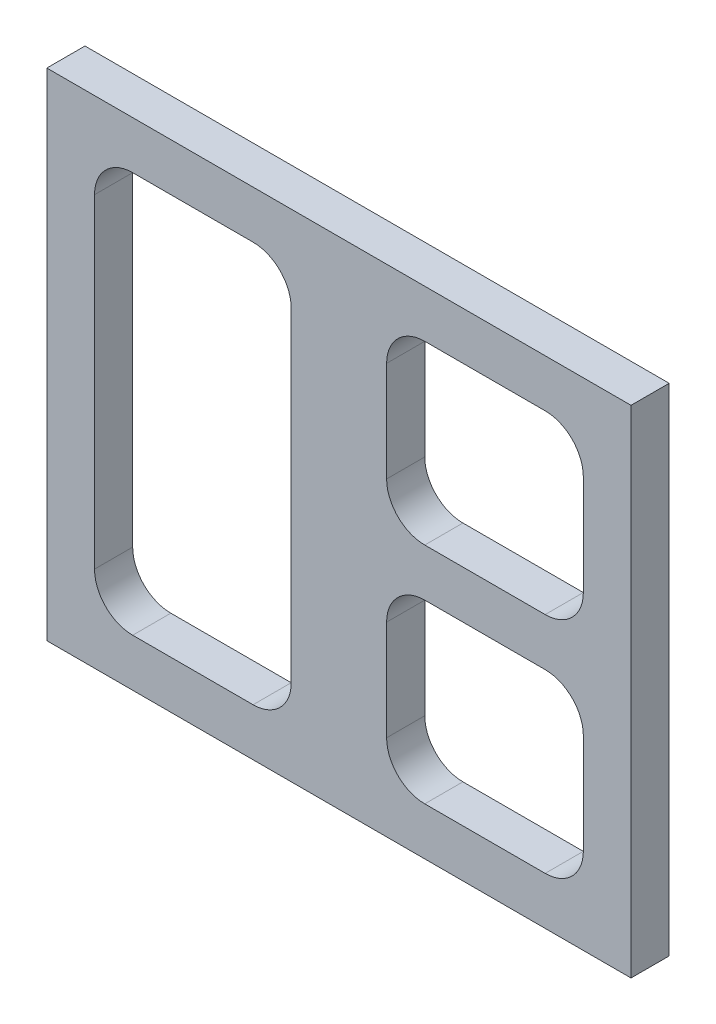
ISO-10303-21;
HEADER;
FILE_DESCRIPTION(('STEP AP214'),'2;1');
FILE_NAME('part.step','',(''),(''),'','','');
FILE_SCHEMA(('AUTOMOTIVE_DESIGN { 1 0 10303 214 1 1 1 1 }'));
ENDSEC;
DATA;
#1=APPLICATION_CONTEXT('core data for automotive mechanical design processes');
#2=APPLICATION_PROTOCOL_DEFINITION('international standard','automotive_design',2000,#1);
#3=PRODUCT_CONTEXT('',#1,'mechanical');
#4=PRODUCT('Part','Part','',(#3));
#5=PRODUCT_RELATED_PRODUCT_CATEGORY('part','',(#4));
#6=PRODUCT_DEFINITION_FORMATION('','',#4);
#7=PRODUCT_DEFINITION_CONTEXT('part definition',#1,'design');
#8=PRODUCT_DEFINITION('design','',#6,#7);
#9=PRODUCT_DEFINITION_SHAPE('','',#8);
#10=(LENGTH_UNIT() NAMED_UNIT(*) SI_UNIT(.MILLI.,.METRE.));
#11=(NAMED_UNIT(*) PLANE_ANGLE_UNIT() SI_UNIT($,.RADIAN.));
#12=(NAMED_UNIT(*) SI_UNIT($,.STERADIAN.) SOLID_ANGLE_UNIT());
#13=UNCERTAINTY_MEASURE_WITH_UNIT(LENGTH_MEASURE(1.E-05),#10,'distance_accuracy_value','');
#14=(GEOMETRIC_REPRESENTATION_CONTEXT(3) GLOBAL_UNCERTAINTY_ASSIGNED_CONTEXT((#13)) GLOBAL_UNIT_ASSIGNED_CONTEXT((#10,
#11,#12)) REPRESENTATION_CONTEXT('',''));
#15=CARTESIAN_POINT('',(0.,0.,0.));
#16=DIRECTION('',(0.,0.,1.));
#17=DIRECTION('',(1.,0.,0.));
#18=AXIS2_PLACEMENT_3D('',#15,#16,#17);
#19=CARTESIAN_POINT('',(122.5,-104.,16.));
#20=DIRECTION('',(0.,0.,1.));
#21=DIRECTION('',(1.,0.,0.));
#22=AXIS2_PLACEMENT_3D('',#19,#20,#21);
#23=PLANE('',#22);
#24=DIRECTION('',(0.,-1.,0.));
#25=VECTOR('',#24,1.);
#26=CARTESIAN_POINT('',(20.,67.9999999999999,16.));
#27=LINE('',#26,#25);
#28=CARTESIAN_POINT('',(20.,67.9999999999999,16.));
#29=VERTEX_POINT('',#28);
#30=CARTESIAN_POINT('',(20.,26.0000000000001,16.));
#31=VERTEX_POINT('',#30);
#32=EDGE_CURVE('E283',#29,#31,#27,.T.);
#33=ORIENTED_EDGE('',*,*,#32,.F.);
#34=CARTESIAN_POINT('',(36.,68.,16.));
#35=DIRECTION('',(0.,0.,1.));
#36=DIRECTION('',(-1.,0.,0.));
#37=AXIS2_PLACEMENT_3D('',#34,#35,#36);
#38=CIRCLE('',#37,16.);
#39=CARTESIAN_POINT('',(36.0000000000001,84.,16.));
#40=VERTEX_POINT('',#39);
#41=EDGE_CURVE('E281',#40,#29,#38,.T.);
#42=ORIENTED_EDGE('',*,*,#41,.F.);
#43=DIRECTION('',(-1.,0.,0.));
#44=VECTOR('',#43,1.);
#45=CARTESIAN_POINT('',(36.0000000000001,84.,16.));
#46=LINE('',#45,#44);
#47=CARTESIAN_POINT('',(86.4999999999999,84.,16.));
#48=VERTEX_POINT('',#47);
#49=EDGE_CURVE('E297',#48,#40,#46,.T.);
#50=ORIENTED_EDGE('',*,*,#49,.F.);
#51=CARTESIAN_POINT('',(86.5,68.,16.));
#52=DIRECTION('',(0.,0.,1.));
#53=DIRECTION('',(1.,0.,0.));
#54=AXIS2_PLACEMENT_3D('',#51,#52,#53);
#55=CIRCLE('',#54,16.);
#56=CARTESIAN_POINT('',(102.5,67.9999999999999,16.));
#57=VERTEX_POINT('',#56);
#58=EDGE_CURVE('E294',#57,#48,#55,.T.);
#59=ORIENTED_EDGE('',*,*,#58,.F.);
#60=DIRECTION('',(0.,1.,0.));
#61=VECTOR('',#60,1.);
#62=CARTESIAN_POINT('',(102.5,67.9999999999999,16.));
#63=LINE('',#62,#61);
#64=CARTESIAN_POINT('',(102.5,26.0000000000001,16.));
#65=VERTEX_POINT('',#64);
#66=EDGE_CURVE('E292',#65,#57,#63,.T.);
#67=ORIENTED_EDGE('',*,*,#66,.F.);
#68=CARTESIAN_POINT('',(86.5,26.,16.));
#69=DIRECTION('',(0.,0.,1.));
#70=DIRECTION('',(1.,0.,0.));
#71=AXIS2_PLACEMENT_3D('',#68,#69,#70);
#72=CIRCLE('',#71,16.);
#73=CARTESIAN_POINT('',(86.4999999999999,10.,16.));
#74=VERTEX_POINT('',#73);
#75=EDGE_CURVE('E290',#74,#65,#72,.T.);
#76=ORIENTED_EDGE('',*,*,#75,.F.);
#77=DIRECTION('',(1.,0.,0.));
#78=VECTOR('',#77,1.);
#79=CARTESIAN_POINT('',(36.0000000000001,10.,16.));
#80=LINE('',#79,#78);
#81=CARTESIAN_POINT('',(36.0000000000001,10.,16.));
#82=VERTEX_POINT('',#81);
#83=EDGE_CURVE('E288',#82,#74,#80,.T.);
#84=ORIENTED_EDGE('',*,*,#83,.F.);
#85=CARTESIAN_POINT('',(36.,26.,16.));
#86=DIRECTION('',(0.,0.,1.));
#87=DIRECTION('',(-1.,0.,0.));
#88=AXIS2_PLACEMENT_3D('',#85,#86,#87);
#89=CIRCLE('',#88,16.);
#90=EDGE_CURVE('E286',#31,#82,#89,.T.);
#91=ORIENTED_EDGE('',*,*,#90,.F.);
#92=EDGE_LOOP('',(#33,#42,#50,#59,#67,#76,#84,#91));
#93=FACE_BOUND('',#92,.T.);
#94=DIRECTION('',(0.,1.,0.));
#95=VECTOR('',#94,1.);
#96=CARTESIAN_POINT('',(122.5,104.,16.));
#97=LINE('',#96,#95);
#98=CARTESIAN_POINT('',(122.5,-104.,16.));
#99=VERTEX_POINT('',#98);
#100=CARTESIAN_POINT('',(122.5,104.,16.));
#101=VERTEX_POINT('',#100);
#102=EDGE_CURVE('E399',#99,#101,#97,.T.);
#103=ORIENTED_EDGE('',*,*,#102,.T.);
#104=DIRECTION('',(-1.,0.,0.));
#105=VECTOR('',#104,1.);
#106=CARTESIAN_POINT('',(-122.5,104.,16.));
#107=LINE('',#106,#105);
#108=CARTESIAN_POINT('',(-122.5,104.,16.));
#109=VERTEX_POINT('',#108);
#110=EDGE_CURVE('E402',#101,#109,#107,.T.);
#111=ORIENTED_EDGE('',*,*,#110,.T.);
#112=DIRECTION('',(0.,-1.,0.));
#113=VECTOR('',#112,1.);
#114=CARTESIAN_POINT('',(-122.5,104.,16.));
#115=LINE('',#114,#113);
#116=CARTESIAN_POINT('',(-122.5,-104.,16.));
#117=VERTEX_POINT('',#116);
#118=EDGE_CURVE('E405',#109,#117,#115,.T.);
#119=ORIENTED_EDGE('',*,*,#118,.T.);
#120=DIRECTION('',(1.,0.,0.));
#121=VECTOR('',#120,1.);
#122=CARTESIAN_POINT('',(-122.5,-104.,16.));
#123=LINE('',#122,#121);
#124=EDGE_CURVE('E407',#117,#99,#123,.T.);
#125=ORIENTED_EDGE('',*,*,#124,.T.);
#126=EDGE_LOOP('',(#103,#111,#119,#125));
#127=FACE_BOUND('',#126,.T.);
#128=DIRECTION('',(0.,-1.,0.));
#129=VECTOR('',#128,1.);
#130=CARTESIAN_POINT('',(-102.5,67.9999999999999,16.));
#131=LINE('',#130,#129);
#132=CARTESIAN_POINT('',(-102.5,67.9999999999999,16.));
#133=VERTEX_POINT('',#132);
#134=CARTESIAN_POINT('',(-102.5,-67.9999999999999,16.));
#135=VERTEX_POINT('',#134);
#136=EDGE_CURVE('E342',#133,#135,#131,.T.);
#137=ORIENTED_EDGE('',*,*,#136,.F.);
#138=CARTESIAN_POINT('',(-86.5,68.,16.));
#139=DIRECTION('',(0.,0.,1.));
#140=DIRECTION('',(-1.,0.,0.));
#141=AXIS2_PLACEMENT_3D('',#138,#139,#140);
#142=CIRCLE('',#141,16.);
#143=CARTESIAN_POINT('',(-86.4999999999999,84.,16.));
#144=VERTEX_POINT('',#143);
#145=EDGE_CURVE('E340',#144,#133,#142,.T.);
#146=ORIENTED_EDGE('',*,*,#145,.F.);
#147=DIRECTION('',(-1.,0.,0.));
#148=VECTOR('',#147,1.);
#149=CARTESIAN_POINT('',(-86.4999999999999,84.,16.));
#150=LINE('',#149,#148);
#151=CARTESIAN_POINT('',(-36.0000000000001,84.,16.));
#152=VERTEX_POINT('',#151);
#153=EDGE_CURVE('E356',#152,#144,#150,.T.);
#154=ORIENTED_EDGE('',*,*,#153,.F.);
#155=CARTESIAN_POINT('',(-36.,68.,16.));
#156=DIRECTION('',(0.,0.,1.));
#157=DIRECTION('',(1.,0.,0.));
#158=AXIS2_PLACEMENT_3D('',#155,#156,#157);
#159=CIRCLE('',#158,16.);
#160=CARTESIAN_POINT('',(-20.,67.9999999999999,16.));
#161=VERTEX_POINT('',#160);
#162=EDGE_CURVE('E353',#161,#152,#159,.T.);
#163=ORIENTED_EDGE('',*,*,#162,.F.);
#164=DIRECTION('',(0.,1.,0.));
#165=VECTOR('',#164,1.);
#166=CARTESIAN_POINT('',(-20.,67.9999999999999,16.));
#167=LINE('',#166,#165);
#168=CARTESIAN_POINT('',(-20.,-67.9999999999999,16.));
#169=VERTEX_POINT('',#168);
#170=EDGE_CURVE('E351',#169,#161,#167,.T.);
#171=ORIENTED_EDGE('',*,*,#170,.F.);
#172=CARTESIAN_POINT('',(-36.,-68.,16.));
#173=DIRECTION('',(0.,0.,1.));
#174=DIRECTION('',(-1.,0.,0.));
#175=AXIS2_PLACEMENT_3D('',#172,#173,#174);
#176=CIRCLE('',#175,16.);
#177=CARTESIAN_POINT('',(-36.0000000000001,-84.,16.));
#178=VERTEX_POINT('',#177);
#179=EDGE_CURVE('E349',#178,#169,#176,.T.);
#180=ORIENTED_EDGE('',*,*,#179,.F.);
#181=DIRECTION('',(1.,0.,0.));
#182=VECTOR('',#181,1.);
#183=CARTESIAN_POINT('',(-86.4999999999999,-84.,16.));
#184=LINE('',#183,#182);
#185=CARTESIAN_POINT('',(-86.4999999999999,-84.,16.));
#186=VERTEX_POINT('',#185);
#187=EDGE_CURVE('E347',#186,#178,#184,.T.);
#188=ORIENTED_EDGE('',*,*,#187,.F.);
#189=CARTESIAN_POINT('',(-86.5,-68.,16.));
#190=DIRECTION('',(0.,0.,1.));
#191=DIRECTION('',(1.,0.,0.));
#192=AXIS2_PLACEMENT_3D('',#189,#190,#191);
#193=CIRCLE('',#192,16.);
#194=EDGE_CURVE('E345',#135,#186,#193,.T.);
#195=ORIENTED_EDGE('',*,*,#194,.F.);
#196=EDGE_LOOP('',(#137,#146,#154,#163,#171,#180,#188,#195));
#197=FACE_BOUND('',#196,.T.);
#198=DIRECTION('',(0.,1.,0.));
#199=VECTOR('',#198,1.);
#200=CARTESIAN_POINT('',(102.5,-26.0000000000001,16.));
#201=LINE('',#200,#199);
#202=CARTESIAN_POINT('',(102.5,-67.9999999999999,16.));
#203=VERTEX_POINT('',#202);
#204=CARTESIAN_POINT('',(102.5,-26.0000000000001,16.));
#205=VERTEX_POINT('',#204);
#206=EDGE_CURVE('E224',#203,#205,#201,.T.);
#207=ORIENTED_EDGE('',*,*,#206,.F.);
#208=CARTESIAN_POINT('',(86.5,-68.,16.));
#209=DIRECTION('',(0.,0.,1.));
#210=DIRECTION('',(1.,0.,0.));
#211=AXIS2_PLACEMENT_3D('',#208,#209,#210);
#212=CIRCLE('',#211,16.);
#213=CARTESIAN_POINT('',(86.4999999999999,-84.,16.));
#214=VERTEX_POINT('',#213);
#215=EDGE_CURVE('E216',#214,#203,#212,.T.);
#216=ORIENTED_EDGE('',*,*,#215,.F.);
#217=DIRECTION('',(1.,0.,0.));
#218=VECTOR('',#217,1.);
#219=CARTESIAN_POINT('',(36.0000000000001,-84.,16.));
#220=LINE('',#219,#218);
#221=CARTESIAN_POINT('',(36.0000000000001,-84.,16.));
#222=VERTEX_POINT('',#221);
#223=EDGE_CURVE('E249',#222,#214,#220,.T.);
#224=ORIENTED_EDGE('',*,*,#223,.F.);
#225=CARTESIAN_POINT('',(36.,-68.,16.));
#226=DIRECTION('',(0.,0.,1.));
#227=DIRECTION('',(1.,0.,0.));
#228=AXIS2_PLACEMENT_3D('',#225,#226,#227);
#229=CIRCLE('',#228,16.);
#230=CARTESIAN_POINT('',(20.,-67.9999999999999,16.));
#231=VERTEX_POINT('',#230);
#232=EDGE_CURVE('E247',#231,#222,#229,.T.);
#233=ORIENTED_EDGE('',*,*,#232,.F.);
#234=DIRECTION('',(0.,-1.,0.));
#235=VECTOR('',#234,1.);
#236=CARTESIAN_POINT('',(20.,-26.0000000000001,16.));
#237=LINE('',#236,#235);
#238=CARTESIAN_POINT('',(20.,-26.0000000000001,16.));
#239=VERTEX_POINT('',#238);
#240=EDGE_CURVE('E245',#239,#231,#237,.T.);
#241=ORIENTED_EDGE('',*,*,#240,.F.);
#242=CARTESIAN_POINT('',(36.,-26.,16.));
#243=DIRECTION('',(0.,0.,1.));
#244=DIRECTION('',(1.,0.,0.));
#245=AXIS2_PLACEMENT_3D('',#242,#243,#244);
#246=CIRCLE('',#245,16.);
#247=CARTESIAN_POINT('',(36.0000000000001,-9.99999999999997,16.));
#248=VERTEX_POINT('',#247);
#249=EDGE_CURVE('E243',#248,#239,#246,.T.);
#250=ORIENTED_EDGE('',*,*,#249,.F.);
#251=DIRECTION('',(-1.,0.,0.));
#252=VECTOR('',#251,1.);
#253=CARTESIAN_POINT('',(36.0000000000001,-9.99999999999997,16.));
#254=LINE('',#253,#252);
#255=CARTESIAN_POINT('',(86.4999999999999,-9.99999999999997,16.));
#256=VERTEX_POINT('',#255);
#257=EDGE_CURVE('E239',#256,#248,#254,.T.);
#258=ORIENTED_EDGE('',*,*,#257,.F.);
#259=CARTESIAN_POINT('',(86.5,-26.,16.));
#260=DIRECTION('',(0.,0.,1.));
#261=DIRECTION('',(-1.,0.,0.));
#262=AXIS2_PLACEMENT_3D('',#259,#260,#261);
#263=CIRCLE('',#262,16.);
#264=EDGE_CURVE('E237',#205,#256,#263,.T.);
#265=ORIENTED_EDGE('',*,*,#264,.F.);
#266=EDGE_LOOP('',(#207,#216,#224,#233,#241,#250,#258,#265));
#267=FACE_BOUND('',#266,.T.);
#268=ADVANCED_FACE('F31',(#93,#127,#197,#267),#23,.T.);
#269=CARTESIAN_POINT('',(122.5,-104.,0.));
#270=DIRECTION('',(0.,0.,1.));
#271=DIRECTION('',(1.,0.,0.));
#272=AXIS2_PLACEMENT_3D('',#269,#270,#271);
#273=PLANE('',#272);
#274=CARTESIAN_POINT('',(36.,68.,0.));
#275=DIRECTION('',(0.,0.,1.));
#276=DIRECTION('',(-1.,0.,0.));
#277=AXIS2_PLACEMENT_3D('',#274,#275,#276);
#278=CIRCLE('',#277,16.);
#279=CARTESIAN_POINT('',(36.0000000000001,84.,0.));
#280=VERTEX_POINT('',#279);
#281=CARTESIAN_POINT('',(20.,67.9999999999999,0.));
#282=VERTEX_POINT('',#281);
#283=EDGE_CURVE('E232',#280,#282,#278,.T.);
#284=ORIENTED_EDGE('',*,*,#283,.T.);
#285=DIRECTION('',(0.,-1.,0.));
#286=VECTOR('',#285,1.);
#287=CARTESIAN_POINT('',(20.,67.9999999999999,0.));
#288=LINE('',#287,#286);
#289=CARTESIAN_POINT('',(20.,26.0000000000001,0.));
#290=VERTEX_POINT('',#289);
#291=EDGE_CURVE('E302',#282,#290,#288,.T.);
#292=ORIENTED_EDGE('',*,*,#291,.T.);
#293=CARTESIAN_POINT('',(36.,26.,0.));
#294=DIRECTION('',(0.,0.,1.));
#295=DIRECTION('',(-1.,0.,0.));
#296=AXIS2_PLACEMENT_3D('',#293,#294,#295);
#297=CIRCLE('',#296,16.);
#298=CARTESIAN_POINT('',(36.0000000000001,10.,0.));
#299=VERTEX_POINT('',#298);
#300=EDGE_CURVE('E305',#290,#299,#297,.T.);
#301=ORIENTED_EDGE('',*,*,#300,.T.);
#302=DIRECTION('',(1.,0.,0.));
#303=VECTOR('',#302,1.);
#304=CARTESIAN_POINT('',(36.0000000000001,10.,0.));
#305=LINE('',#304,#303);
#306=CARTESIAN_POINT('',(86.4999999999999,10.,0.));
#307=VERTEX_POINT('',#306);
#308=EDGE_CURVE('E308',#299,#307,#305,.T.);
#309=ORIENTED_EDGE('',*,*,#308,.T.);
#310=CARTESIAN_POINT('',(86.5,26.,0.));
#311=DIRECTION('',(0.,0.,1.));
#312=DIRECTION('',(1.,0.,0.));
#313=AXIS2_PLACEMENT_3D('',#310,#311,#312);
#314=CIRCLE('',#313,16.);
#315=CARTESIAN_POINT('',(102.5,26.0000000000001,0.));
#316=VERTEX_POINT('',#315);
#317=EDGE_CURVE('E311',#307,#316,#314,.T.);
#318=ORIENTED_EDGE('',*,*,#317,.T.);
#319=DIRECTION('',(0.,1.,0.));
#320=VECTOR('',#319,1.);
#321=CARTESIAN_POINT('',(102.5,67.9999999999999,0.));
#322=LINE('',#321,#320);
#323=CARTESIAN_POINT('',(102.5,67.9999999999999,0.));
#324=VERTEX_POINT('',#323);
#325=EDGE_CURVE('E314',#316,#324,#322,.T.);
#326=ORIENTED_EDGE('',*,*,#325,.T.);
#327=CARTESIAN_POINT('',(86.5,68.,0.));
#328=DIRECTION('',(0.,0.,1.));
#329=DIRECTION('',(1.,0.,0.));
#330=AXIS2_PLACEMENT_3D('',#327,#328,#329);
#331=CIRCLE('',#330,16.);
#332=CARTESIAN_POINT('',(86.4999999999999,84.,0.));
#333=VERTEX_POINT('',#332);
#334=EDGE_CURVE('E317',#324,#333,#331,.T.);
#335=ORIENTED_EDGE('',*,*,#334,.T.);
#336=DIRECTION('',(-1.,0.,0.));
#337=VECTOR('',#336,1.);
#338=CARTESIAN_POINT('',(36.0000000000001,84.,0.));
#339=LINE('',#338,#337);
#340=EDGE_CURVE('E284',#333,#280,#339,.T.);
#341=ORIENTED_EDGE('',*,*,#340,.T.);
#342=EDGE_LOOP('',(#284,#292,#301,#309,#318,#326,#335,#341));
#343=FACE_BOUND('',#342,.T.);
#344=DIRECTION('',(0.,1.,0.));
#345=VECTOR('',#344,1.);
#346=CARTESIAN_POINT('',(122.5,104.,0.));
#347=LINE('',#346,#345);
#348=CARTESIAN_POINT('',(122.5,-104.,0.));
#349=VERTEX_POINT('',#348);
#350=CARTESIAN_POINT('',(122.5,104.,0.));
#351=VERTEX_POINT('',#350);
#352=EDGE_CURVE('E398',#349,#351,#347,.T.);
#353=ORIENTED_EDGE('',*,*,#352,.F.);
#354=DIRECTION('',(1.,0.,0.));
#355=VECTOR('',#354,1.);
#356=CARTESIAN_POINT('',(-122.5,-104.,0.));
#357=LINE('',#356,#355);
#358=CARTESIAN_POINT('',(-122.5,-104.,0.));
#359=VERTEX_POINT('',#358);
#360=EDGE_CURVE('E403',#359,#349,#357,.T.);
#361=ORIENTED_EDGE('',*,*,#360,.F.);
#362=DIRECTION('',(0.,-1.,0.));
#363=VECTOR('',#362,1.);
#364=CARTESIAN_POINT('',(-122.5,104.,0.));
#365=LINE('',#364,#363);
#366=CARTESIAN_POINT('',(-122.5,104.,0.));
#367=VERTEX_POINT('',#366);
#368=EDGE_CURVE('E414',#367,#359,#365,.T.);
#369=ORIENTED_EDGE('',*,*,#368,.F.);
#370=DIRECTION('',(-1.,0.,0.));
#371=VECTOR('',#370,1.);
#372=CARTESIAN_POINT('',(-122.5,104.,0.));
#373=LINE('',#372,#371);
#374=EDGE_CURVE('E412',#351,#367,#373,.T.);
#375=ORIENTED_EDGE('',*,*,#374,.F.);
#376=EDGE_LOOP('',(#353,#361,#369,#375));
#377=FACE_BOUND('',#376,.T.);
#378=CARTESIAN_POINT('',(-86.5,68.,0.));
#379=DIRECTION('',(0.,0.,1.));
#380=DIRECTION('',(-1.,0.,0.));
#381=AXIS2_PLACEMENT_3D('',#378,#379,#380);
#382=CIRCLE('',#381,16.);
#383=CARTESIAN_POINT('',(-86.4999999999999,84.,0.));
#384=VERTEX_POINT('',#383);
#385=CARTESIAN_POINT('',(-102.5,67.9999999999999,0.));
#386=VERTEX_POINT('',#385);
#387=EDGE_CURVE('E339',#384,#386,#382,.T.);
#388=ORIENTED_EDGE('',*,*,#387,.T.);
#389=DIRECTION('',(0.,-1.,0.));
#390=VECTOR('',#389,1.);
#391=CARTESIAN_POINT('',(-102.5,67.9999999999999,0.));
#392=LINE('',#391,#390);
#393=CARTESIAN_POINT('',(-102.5,-67.9999999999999,0.));
#394=VERTEX_POINT('',#393);
#395=EDGE_CURVE('E361',#386,#394,#392,.T.);
#396=ORIENTED_EDGE('',*,*,#395,.T.);
#397=CARTESIAN_POINT('',(-86.5,-68.,0.));
#398=DIRECTION('',(0.,0.,1.));
#399=DIRECTION('',(1.,0.,0.));
#400=AXIS2_PLACEMENT_3D('',#397,#398,#399);
#401=CIRCLE('',#400,16.);
#402=CARTESIAN_POINT('',(-86.4999999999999,-84.,0.));
#403=VERTEX_POINT('',#402);
#404=EDGE_CURVE('E364',#394,#403,#401,.T.);
#405=ORIENTED_EDGE('',*,*,#404,.T.);
#406=DIRECTION('',(1.,0.,0.));
#407=VECTOR('',#406,1.);
#408=CARTESIAN_POINT('',(-86.4999999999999,-84.,0.));
#409=LINE('',#408,#407);
#410=CARTESIAN_POINT('',(-36.0000000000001,-84.,0.));
#411=VERTEX_POINT('',#410);
#412=EDGE_CURVE('E367',#403,#411,#409,.T.);
#413=ORIENTED_EDGE('',*,*,#412,.T.);
#414=CARTESIAN_POINT('',(-36.,-68.,0.));
#415=DIRECTION('',(0.,0.,1.));
#416=DIRECTION('',(-1.,0.,0.));
#417=AXIS2_PLACEMENT_3D('',#414,#415,#416);
#418=CIRCLE('',#417,16.);
#419=CARTESIAN_POINT('',(-20.,-67.9999999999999,0.));
#420=VERTEX_POINT('',#419);
#421=EDGE_CURVE('E370',#411,#420,#418,.T.);
#422=ORIENTED_EDGE('',*,*,#421,.T.);
#423=DIRECTION('',(0.,1.,0.));
#424=VECTOR('',#423,1.);
#425=CARTESIAN_POINT('',(-20.,67.9999999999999,0.));
#426=LINE('',#425,#424);
#427=CARTESIAN_POINT('',(-20.,67.9999999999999,0.));
#428=VERTEX_POINT('',#427);
#429=EDGE_CURVE('E373',#420,#428,#426,.T.);
#430=ORIENTED_EDGE('',*,*,#429,.T.);
#431=CARTESIAN_POINT('',(-36.,68.,0.));
#432=DIRECTION('',(0.,0.,1.));
#433=DIRECTION('',(1.,0.,0.));
#434=AXIS2_PLACEMENT_3D('',#431,#432,#433);
#435=CIRCLE('',#434,16.);
#436=CARTESIAN_POINT('',(-36.0000000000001,84.,0.));
#437=VERTEX_POINT('',#436);
#438=EDGE_CURVE('E376',#428,#437,#435,.T.);
#439=ORIENTED_EDGE('',*,*,#438,.T.);
#440=DIRECTION('',(-1.,0.,0.));
#441=VECTOR('',#440,1.);
#442=CARTESIAN_POINT('',(-86.4999999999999,84.,0.));
#443=LINE('',#442,#441);
#444=EDGE_CURVE('E343',#437,#384,#443,.T.);
#445=ORIENTED_EDGE('',*,*,#444,.T.);
#446=EDGE_LOOP('',(#388,#396,#405,#413,#422,#430,#439,#445));
#447=FACE_BOUND('',#446,.T.);
#448=CARTESIAN_POINT('',(86.5,-68.,0.));
#449=DIRECTION('',(0.,0.,1.));
#450=DIRECTION('',(1.,0.,0.));
#451=AXIS2_PLACEMENT_3D('',#448,#449,#450);
#452=CIRCLE('',#451,16.);
#453=CARTESIAN_POINT('',(86.4999999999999,-84.,0.));
#454=VERTEX_POINT('',#453);
#455=CARTESIAN_POINT('',(102.5,-67.9999999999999,0.));
#456=VERTEX_POINT('',#455);
#457=EDGE_CURVE('E54',#454,#456,#452,.T.);
#458=ORIENTED_EDGE('',*,*,#457,.T.);
#459=DIRECTION('',(0.,1.,0.));
#460=VECTOR('',#459,1.);
#461=CARTESIAN_POINT('',(102.5,-26.0000000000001,0.));
#462=LINE('',#461,#460);
#463=CARTESIAN_POINT('',(102.5,-26.0000000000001,0.));
#464=VERTEX_POINT('',#463);
#465=EDGE_CURVE('E231',#456,#464,#462,.T.);
#466=ORIENTED_EDGE('',*,*,#465,.T.);
#467=CARTESIAN_POINT('',(86.5,-26.,0.));
#468=DIRECTION('',(0.,0.,1.));
#469=DIRECTION('',(-1.,0.,0.));
#470=AXIS2_PLACEMENT_3D('',#467,#468,#469);
#471=CIRCLE('',#470,16.);
#472=CARTESIAN_POINT('',(86.4999999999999,-9.99999999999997,0.));
#473=VERTEX_POINT('',#472);
#474=EDGE_CURVE('E253',#464,#473,#471,.T.);
#475=ORIENTED_EDGE('',*,*,#474,.T.);
#476=DIRECTION('',(-1.,0.,0.));
#477=VECTOR('',#476,1.);
#478=CARTESIAN_POINT('',(36.0000000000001,-9.99999999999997,0.));
#479=LINE('',#478,#477);
#480=CARTESIAN_POINT('',(36.0000000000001,-9.99999999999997,0.));
#481=VERTEX_POINT('',#480);
#482=EDGE_CURVE('E256',#473,#481,#479,.T.);
#483=ORIENTED_EDGE('',*,*,#482,.T.);
#484=CARTESIAN_POINT('',(36.,-26.,0.));
#485=DIRECTION('',(0.,0.,1.));
#486=DIRECTION('',(1.,0.,0.));
#487=AXIS2_PLACEMENT_3D('',#484,#485,#486);
#488=CIRCLE('',#487,16.);
#489=CARTESIAN_POINT('',(20.,-26.0000000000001,0.));
#490=VERTEX_POINT('',#489);
#491=EDGE_CURVE('E259',#481,#490,#488,.T.);
#492=ORIENTED_EDGE('',*,*,#491,.T.);
#493=DIRECTION('',(0.,-1.,0.));
#494=VECTOR('',#493,1.);
#495=CARTESIAN_POINT('',(20.,-26.0000000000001,0.));
#496=LINE('',#495,#494);
#497=CARTESIAN_POINT('',(20.,-67.9999999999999,0.));
#498=VERTEX_POINT('',#497);
#499=EDGE_CURVE('E262',#490,#498,#496,.T.);
#500=ORIENTED_EDGE('',*,*,#499,.T.);
#501=CARTESIAN_POINT('',(36.,-68.,0.));
#502=DIRECTION('',(0.,0.,1.));
#503=DIRECTION('',(1.,0.,0.));
#504=AXIS2_PLACEMENT_3D('',#501,#502,#503);
#505=CIRCLE('',#504,16.);
#506=CARTESIAN_POINT('',(36.0000000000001,-84.,0.));
#507=VERTEX_POINT('',#506);
#508=EDGE_CURVE('E265',#498,#507,#505,.T.);
#509=ORIENTED_EDGE('',*,*,#508,.T.);
#510=DIRECTION('',(1.,0.,0.));
#511=VECTOR('',#510,1.);
#512=CARTESIAN_POINT('',(36.0000000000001,-84.,0.));
#513=LINE('',#512,#511);
#514=EDGE_CURVE('E225',#507,#454,#513,.T.);
#515=ORIENTED_EDGE('',*,*,#514,.T.);
#516=EDGE_LOOP('',(#458,#466,#475,#483,#492,#500,#509,#515));
#517=FACE_BOUND('',#516,.T.);
#518=ADVANCED_FACE('F432',(#343,#377,#447,#517),#273,.F.);
#519=CARTESIAN_POINT('',(122.5,104.,16.));
#520=DIRECTION('',(-1.,0.,0.));
#521=DIRECTION('',(0.,-1.,0.));
#522=AXIS2_PLACEMENT_3D('',#519,#520,#521);
#523=PLANE('',#522);
#524=ORIENTED_EDGE('',*,*,#352,.T.);
#525=DIRECTION('',(0.,0.,-1.));
#526=VECTOR('',#525,1.);
#527=CARTESIAN_POINT('',(122.5,104.,16.));
#528=LINE('',#527,#526);
#529=EDGE_CURVE('E11',#101,#351,#528,.T.);
#530=ORIENTED_EDGE('',*,*,#529,.F.);
#531=ORIENTED_EDGE('',*,*,#102,.F.);
#532=DIRECTION('',(0.,0.,-1.));
#533=VECTOR('',#532,1.);
#534=CARTESIAN_POINT('',(122.5,-104.,16.));
#535=LINE('',#534,#533);
#536=EDGE_CURVE('E409',#99,#349,#535,.T.);
#537=ORIENTED_EDGE('',*,*,#536,.T.);
#538=EDGE_LOOP('',(#524,#530,#531,#537));
#539=FACE_BOUND('',#538,.T.);
#540=ADVANCED_FACE('F33',(#539),#523,.F.);
#541=CARTESIAN_POINT('',(-122.5,104.,16.));
#542=DIRECTION('',(0.,-1.,0.));
#543=DIRECTION('',(0.,0.,-1.));
#544=AXIS2_PLACEMENT_3D('',#541,#542,#543);
#545=PLANE('',#544);
#546=ORIENTED_EDGE('',*,*,#374,.T.);
#547=DIRECTION('',(0.,0.,-1.));
#548=VECTOR('',#547,1.);
#549=CARTESIAN_POINT('',(-122.5,104.,16.));
#550=LINE('',#549,#548);
#551=EDGE_CURVE('E39',#109,#367,#550,.T.);
#552=ORIENTED_EDGE('',*,*,#551,.F.);
#553=ORIENTED_EDGE('',*,*,#110,.F.);
#554=ORIENTED_EDGE('',*,*,#529,.T.);
#555=EDGE_LOOP('',(#546,#552,#553,#554));
#556=FACE_BOUND('',#555,.T.);
#557=ADVANCED_FACE('F443',(#556),#545,.F.);
#558=CARTESIAN_POINT('',(-122.5,104.,16.));
#559=DIRECTION('',(1.,0.,0.));
#560=DIRECTION('',(0.,1.,0.));
#561=AXIS2_PLACEMENT_3D('',#558,#559,#560);
#562=PLANE('',#561);
#563=ORIENTED_EDGE('',*,*,#368,.T.);
#564=DIRECTION('',(0.,0.,-1.));
#565=VECTOR('',#564,1.);
#566=CARTESIAN_POINT('',(-122.5,-104.,16.));
#567=LINE('',#566,#565);
#568=EDGE_CURVE('E419',#117,#359,#567,.T.);
#569=ORIENTED_EDGE('',*,*,#568,.F.);
#570=ORIENTED_EDGE('',*,*,#118,.F.);
#571=ORIENTED_EDGE('',*,*,#551,.T.);
#572=EDGE_LOOP('',(#563,#569,#570,#571));
#573=FACE_BOUND('',#572,.T.);
#574=ADVANCED_FACE('F426',(#573),#562,.F.);
#575=CARTESIAN_POINT('',(-122.5,-104.,16.));
#576=DIRECTION('',(0.,1.,0.));
#577=DIRECTION('',(-1.,0.,0.));
#578=AXIS2_PLACEMENT_3D('',#575,#576,#577);
#579=PLANE('',#578);
#580=ORIENTED_EDGE('',*,*,#360,.T.);
#581=ORIENTED_EDGE('',*,*,#536,.F.);
#582=ORIENTED_EDGE('',*,*,#124,.F.);
#583=ORIENTED_EDGE('',*,*,#568,.T.);
#584=EDGE_LOOP('',(#580,#581,#582,#583));
#585=FACE_BOUND('',#584,.T.);
#586=ADVANCED_FACE('F436',(#585),#579,.F.);
#587=CARTESIAN_POINT('',(-86.5,68.,16.));
#588=DIRECTION('',(0.,0.,-1.));
#589=DIRECTION('',(-1.,0.,0.));
#590=AXIS2_PLACEMENT_3D('',#587,#588,#589);
#591=CYLINDRICAL_SURFACE('',#590,16.);
#592=ORIENTED_EDGE('',*,*,#387,.F.);
#593=DIRECTION('',(0.,0.,-1.));
#594=VECTOR('',#593,1.);
#595=CARTESIAN_POINT('',(-86.4999999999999,84.,16.));
#596=LINE('',#595,#594);
#597=EDGE_CURVE('E358',#144,#384,#596,.T.);
#598=ORIENTED_EDGE('',*,*,#597,.F.);
#599=ORIENTED_EDGE('',*,*,#145,.T.);
#600=DIRECTION('',(0.,0.,-1.));
#601=VECTOR('',#600,1.);
#602=CARTESIAN_POINT('',(-102.5,67.9999999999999,16.));
#603=LINE('',#602,#601);
#604=EDGE_CURVE('E395',#133,#386,#603,.T.);
#605=ORIENTED_EDGE('',*,*,#604,.T.);
#606=EDGE_LOOP('',(#592,#598,#599,#605));
#607=FACE_BOUND('',#606,.T.);
#608=ADVANCED_FACE('F460',(#607),#591,.F.);
#609=CARTESIAN_POINT('',(-102.5,67.9999999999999,16.));
#610=DIRECTION('',(1.,0.,0.));
#611=DIRECTION('',(0.,1.,0.));
#612=AXIS2_PLACEMENT_3D('',#609,#610,#611);
#613=PLANE('',#612);
#614=ORIENTED_EDGE('',*,*,#395,.F.);
#615=ORIENTED_EDGE('',*,*,#604,.F.);
#616=ORIENTED_EDGE('',*,*,#136,.T.);
#617=DIRECTION('',(0.,0.,-1.));
#618=VECTOR('',#617,1.);
#619=CARTESIAN_POINT('',(-102.5,-67.9999999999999,16.));
#620=LINE('',#619,#618);
#621=EDGE_CURVE('E393',#135,#394,#620,.T.);
#622=ORIENTED_EDGE('',*,*,#621,.T.);
#623=EDGE_LOOP('',(#614,#615,#616,#622));
#624=FACE_BOUND('',#623,.T.);
#625=ADVANCED_FACE('F467',(#624),#613,.T.);
#626=CARTESIAN_POINT('',(-86.5,-68.,16.));
#627=DIRECTION('',(0.,0.,-1.));
#628=DIRECTION('',(-1.,0.,0.));
#629=AXIS2_PLACEMENT_3D('',#626,#627,#628);
#630=CYLINDRICAL_SURFACE('',#629,16.);
#631=ORIENTED_EDGE('',*,*,#404,.F.);
#632=ORIENTED_EDGE('',*,*,#621,.F.);
#633=ORIENTED_EDGE('',*,*,#194,.T.);
#634=DIRECTION('',(0.,0.,-1.));
#635=VECTOR('',#634,1.);
#636=CARTESIAN_POINT('',(-86.4999999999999,-84.,16.));
#637=LINE('',#636,#635);
#638=EDGE_CURVE('E391',#186,#403,#637,.T.);
#639=ORIENTED_EDGE('',*,*,#638,.T.);
#640=EDGE_LOOP('',(#631,#632,#633,#639));
#641=FACE_BOUND('',#640,.T.);
#642=ADVANCED_FACE('F472',(#641),#630,.F.);
#643=CARTESIAN_POINT('',(-86.4999999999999,-84.,16.));
#644=DIRECTION('',(0.,1.,0.));
#645=DIRECTION('',(-1.,0.,0.));
#646=AXIS2_PLACEMENT_3D('',#643,#644,#645);
#647=PLANE('',#646);
#648=ORIENTED_EDGE('',*,*,#412,.F.);
#649=ORIENTED_EDGE('',*,*,#638,.F.);
#650=ORIENTED_EDGE('',*,*,#187,.T.);
#651=DIRECTION('',(0.,0.,-1.));
#652=VECTOR('',#651,1.);
#653=CARTESIAN_POINT('',(-36.0000000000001,-84.,16.));
#654=LINE('',#653,#652);
#655=EDGE_CURVE('E389',#178,#411,#654,.T.);
#656=ORIENTED_EDGE('',*,*,#655,.T.);
#657=EDGE_LOOP('',(#648,#649,#650,#656));
#658=FACE_BOUND('',#657,.T.);
#659=ADVANCED_FACE('F498',(#658),#647,.T.);
#660=CARTESIAN_POINT('',(-36.,-68.,16.));
#661=DIRECTION('',(0.,0.,-1.));
#662=DIRECTION('',(-1.,0.,0.));
#663=AXIS2_PLACEMENT_3D('',#660,#661,#662);
#664=CYLINDRICAL_SURFACE('',#663,16.);
#665=ORIENTED_EDGE('',*,*,#421,.F.);
#666=ORIENTED_EDGE('',*,*,#655,.F.);
#667=ORIENTED_EDGE('',*,*,#179,.T.);
#668=DIRECTION('',(0.,0.,-1.));
#669=VECTOR('',#668,1.);
#670=CARTESIAN_POINT('',(-20.,-67.9999999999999,16.));
#671=LINE('',#670,#669);
#672=EDGE_CURVE('E387',#169,#420,#671,.T.);
#673=ORIENTED_EDGE('',*,*,#672,.T.);
#674=EDGE_LOOP('',(#665,#666,#667,#673));
#675=FACE_BOUND('',#674,.T.);
#676=ADVANCED_FACE('F503',(#675),#664,.F.);
#677=CARTESIAN_POINT('',(-20.,67.9999999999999,16.));
#678=DIRECTION('',(-1.,0.,0.));
#679=DIRECTION('',(0.,-1.,0.));
#680=AXIS2_PLACEMENT_3D('',#677,#678,#679);
#681=PLANE('',#680);
#682=ORIENTED_EDGE('',*,*,#429,.F.);
#683=ORIENTED_EDGE('',*,*,#672,.F.);
#684=ORIENTED_EDGE('',*,*,#170,.T.);
#685=DIRECTION('',(0.,0.,-1.));
#686=VECTOR('',#685,1.);
#687=CARTESIAN_POINT('',(-20.,67.9999999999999,16.));
#688=LINE('',#687,#686);
#689=EDGE_CURVE('E385',#161,#428,#688,.T.);
#690=ORIENTED_EDGE('',*,*,#689,.T.);
#691=EDGE_LOOP('',(#682,#683,#684,#690));
#692=FACE_BOUND('',#691,.T.);
#693=ADVANCED_FACE('F506',(#692),#681,.T.);
#694=CARTESIAN_POINT('',(-36.,68.,16.));
#695=DIRECTION('',(0.,0.,-1.));
#696=DIRECTION('',(-1.,0.,0.));
#697=AXIS2_PLACEMENT_3D('',#694,#695,#696);
#698=CYLINDRICAL_SURFACE('',#697,16.);
#699=ORIENTED_EDGE('',*,*,#438,.F.);
#700=ORIENTED_EDGE('',*,*,#689,.F.);
#701=ORIENTED_EDGE('',*,*,#162,.T.);
#702=DIRECTION('',(0.,0.,-1.));
#703=VECTOR('',#702,1.);
#704=CARTESIAN_POINT('',(-36.0000000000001,84.,16.));
#705=LINE('',#704,#703);
#706=EDGE_CURVE('E383',#152,#437,#705,.T.);
#707=ORIENTED_EDGE('',*,*,#706,.T.);
#708=EDGE_LOOP('',(#699,#700,#701,#707));
#709=FACE_BOUND('',#708,.T.);
#710=ADVANCED_FACE('F486',(#709),#698,.F.);
#711=CARTESIAN_POINT('',(-86.4999999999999,84.,16.));
#712=DIRECTION('',(0.,-1.,0.));
#713=DIRECTION('',(0.,0.,-1.));
#714=AXIS2_PLACEMENT_3D('',#711,#712,#713);
#715=PLANE('',#714);
#716=ORIENTED_EDGE('',*,*,#444,.F.);
#717=ORIENTED_EDGE('',*,*,#706,.F.);
#718=ORIENTED_EDGE('',*,*,#153,.T.);
#719=ORIENTED_EDGE('',*,*,#597,.T.);
#720=EDGE_LOOP('',(#716,#717,#718,#719));
#721=FACE_BOUND('',#720,.T.);
#722=ADVANCED_FACE('F479',(#721),#715,.T.);
#723=CARTESIAN_POINT('',(36.,68.,16.));
#724=DIRECTION('',(0.,0.,-1.));
#725=DIRECTION('',(-1.,0.,0.));
#726=AXIS2_PLACEMENT_3D('',#723,#724,#725);
#727=CYLINDRICAL_SURFACE('',#726,16.);
#728=ORIENTED_EDGE('',*,*,#283,.F.);
#729=DIRECTION('',(0.,0.,-1.));
#730=VECTOR('',#729,1.);
#731=CARTESIAN_POINT('',(36.0000000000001,84.,16.));
#732=LINE('',#731,#730);
#733=EDGE_CURVE('E299',#40,#280,#732,.T.);
#734=ORIENTED_EDGE('',*,*,#733,.F.);
#735=ORIENTED_EDGE('',*,*,#41,.T.);
#736=DIRECTION('',(0.,0.,-1.));
#737=VECTOR('',#736,1.);
#738=CARTESIAN_POINT('',(20.,67.9999999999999,16.));
#739=LINE('',#738,#737);
#740=EDGE_CURVE('E336',#29,#282,#739,.T.);
#741=ORIENTED_EDGE('',*,*,#740,.T.);
#742=EDGE_LOOP('',(#728,#734,#735,#741));
#743=FACE_BOUND('',#742,.T.);
#744=ADVANCED_FACE('F551',(#743),#727,.F.);
#745=CARTESIAN_POINT('',(20.,67.9999999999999,16.));
#746=DIRECTION('',(1.,0.,0.));
#747=DIRECTION('',(0.,1.,0.));
#748=AXIS2_PLACEMENT_3D('',#745,#746,#747);
#749=PLANE('',#748);
#750=ORIENTED_EDGE('',*,*,#291,.F.);
#751=ORIENTED_EDGE('',*,*,#740,.F.);
#752=ORIENTED_EDGE('',*,*,#32,.T.);
#753=DIRECTION('',(0.,0.,-1.));
#754=VECTOR('',#753,1.);
#755=CARTESIAN_POINT('',(20.,26.0000000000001,16.));
#756=LINE('',#755,#754);
#757=EDGE_CURVE('E334',#31,#290,#756,.T.);
#758=ORIENTED_EDGE('',*,*,#757,.T.);
#759=EDGE_LOOP('',(#750,#751,#752,#758));
#760=FACE_BOUND('',#759,.T.);
#761=ADVANCED_FACE('F559',(#760),#749,.T.);
#762=CARTESIAN_POINT('',(36.,26.,16.));
#763=DIRECTION('',(0.,0.,-1.));
#764=DIRECTION('',(-1.,0.,0.));
#765=AXIS2_PLACEMENT_3D('',#762,#763,#764);
#766=CYLINDRICAL_SURFACE('',#765,16.);
#767=ORIENTED_EDGE('',*,*,#300,.F.);
#768=ORIENTED_EDGE('',*,*,#757,.F.);
#769=ORIENTED_EDGE('',*,*,#90,.T.);
#770=DIRECTION('',(0.,0.,-1.));
#771=VECTOR('',#770,1.);
#772=CARTESIAN_POINT('',(36.0000000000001,10.,16.));
#773=LINE('',#772,#771);
#774=EDGE_CURVE('E332',#82,#299,#773,.T.);
#775=ORIENTED_EDGE('',*,*,#774,.T.);
#776=EDGE_LOOP('',(#767,#768,#769,#775));
#777=FACE_BOUND('',#776,.T.);
#778=ADVANCED_FACE('F569',(#777),#766,.F.);
#779=CARTESIAN_POINT('',(36.0000000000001,10.,16.));
#780=DIRECTION('',(0.,1.,0.));
#781=DIRECTION('',(-1.,0.,0.));
#782=AXIS2_PLACEMENT_3D('',#779,#780,#781);
#783=PLANE('',#782);
#784=ORIENTED_EDGE('',*,*,#308,.F.);
#785=ORIENTED_EDGE('',*,*,#774,.F.);
#786=ORIENTED_EDGE('',*,*,#83,.T.);
#787=DIRECTION('',(0.,0.,-1.));
#788=VECTOR('',#787,1.);
#789=CARTESIAN_POINT('',(86.4999999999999,10.,16.));
#790=LINE('',#789,#788);
#791=EDGE_CURVE('E330',#74,#307,#790,.T.);
#792=ORIENTED_EDGE('',*,*,#791,.T.);
#793=EDGE_LOOP('',(#784,#785,#786,#792));
#794=FACE_BOUND('',#793,.T.);
#795=ADVANCED_FACE('F579',(#794),#783,.T.);
#796=CARTESIAN_POINT('',(86.5,26.,16.));
#797=DIRECTION('',(0.,0.,-1.));
#798=DIRECTION('',(-1.,0.,0.));
#799=AXIS2_PLACEMENT_3D('',#796,#797,#798);
#800=CYLINDRICAL_SURFACE('',#799,16.);
#801=ORIENTED_EDGE('',*,*,#317,.F.);
#802=ORIENTED_EDGE('',*,*,#791,.F.);
#803=ORIENTED_EDGE('',*,*,#75,.T.);
#804=DIRECTION('',(0.,0.,-1.));
#805=VECTOR('',#804,1.);
#806=CARTESIAN_POINT('',(102.5,26.0000000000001,16.));
#807=LINE('',#806,#805);
#808=EDGE_CURVE('E328',#65,#316,#807,.T.);
#809=ORIENTED_EDGE('',*,*,#808,.T.);
#810=EDGE_LOOP('',(#801,#802,#803,#809));
#811=FACE_BOUND('',#810,.T.);
#812=ADVANCED_FACE('F589',(#811),#800,.F.);
#813=CARTESIAN_POINT('',(102.5,67.9999999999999,16.));
#814=DIRECTION('',(-1.,0.,0.));
#815=DIRECTION('',(0.,-1.,0.));
#816=AXIS2_PLACEMENT_3D('',#813,#814,#815);
#817=PLANE('',#816);
#818=ORIENTED_EDGE('',*,*,#325,.F.);
#819=ORIENTED_EDGE('',*,*,#808,.F.);
#820=ORIENTED_EDGE('',*,*,#66,.T.);
#821=DIRECTION('',(0.,0.,-1.));
#822=VECTOR('',#821,1.);
#823=CARTESIAN_POINT('',(102.5,67.9999999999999,16.));
#824=LINE('',#823,#822);
#825=EDGE_CURVE('E326',#57,#324,#824,.T.);
#826=ORIENTED_EDGE('',*,*,#825,.T.);
#827=EDGE_LOOP('',(#818,#819,#820,#826));
#828=FACE_BOUND('',#827,.T.);
#829=ADVANCED_FACE('F599',(#828),#817,.T.);
#830=CARTESIAN_POINT('',(86.5,68.,16.));
#831=DIRECTION('',(0.,0.,-1.));
#832=DIRECTION('',(-1.,0.,0.));
#833=AXIS2_PLACEMENT_3D('',#830,#831,#832);
#834=CYLINDRICAL_SURFACE('',#833,16.);
#835=ORIENTED_EDGE('',*,*,#334,.F.);
#836=ORIENTED_EDGE('',*,*,#825,.F.);
#837=ORIENTED_EDGE('',*,*,#58,.T.);
#838=DIRECTION('',(0.,0.,-1.));
#839=VECTOR('',#838,1.);
#840=CARTESIAN_POINT('',(86.4999999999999,84.,16.));
#841=LINE('',#840,#839);
#842=EDGE_CURVE('E324',#48,#333,#841,.T.);
#843=ORIENTED_EDGE('',*,*,#842,.T.);
#844=EDGE_LOOP('',(#835,#836,#837,#843));
#845=FACE_BOUND('',#844,.T.);
#846=ADVANCED_FACE('F609',(#845),#834,.F.);
#847=CARTESIAN_POINT('',(36.0000000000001,84.,16.));
#848=DIRECTION('',(0.,-1.,0.));
#849=DIRECTION('',(0.,0.,-1.));
#850=AXIS2_PLACEMENT_3D('',#847,#848,#849);
#851=PLANE('',#850);
#852=ORIENTED_EDGE('',*,*,#340,.F.);
#853=ORIENTED_EDGE('',*,*,#842,.F.);
#854=ORIENTED_EDGE('',*,*,#49,.T.);
#855=ORIENTED_EDGE('',*,*,#733,.T.);
#856=EDGE_LOOP('',(#852,#853,#854,#855));
#857=FACE_BOUND('',#856,.T.);
#858=ADVANCED_FACE('F619',(#857),#851,.T.);
#859=CARTESIAN_POINT('',(86.5,-68.,16.));
#860=DIRECTION('',(0.,0.,-1.));
#861=DIRECTION('',(-1.,0.,0.));
#862=AXIS2_PLACEMENT_3D('',#859,#860,#861);
#863=CYLINDRICAL_SURFACE('',#862,16.);
#864=ORIENTED_EDGE('',*,*,#457,.F.);
#865=DIRECTION('',(0.,0.,-1.));
#866=VECTOR('',#865,1.);
#867=CARTESIAN_POINT('',(86.4999999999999,-84.,16.));
#868=LINE('',#867,#866);
#869=EDGE_CURVE('E220',#214,#454,#868,.T.);
#870=ORIENTED_EDGE('',*,*,#869,.F.);
#871=ORIENTED_EDGE('',*,*,#215,.T.);
#872=DIRECTION('',(0.,0.,-1.));
#873=VECTOR('',#872,1.);
#874=CARTESIAN_POINT('',(102.5,-67.9999999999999,16.));
#875=LINE('',#874,#873);
#876=EDGE_CURVE('E219',#203,#456,#875,.T.);
#877=ORIENTED_EDGE('',*,*,#876,.T.);
#878=EDGE_LOOP('',(#864,#870,#871,#877));
#879=FACE_BOUND('',#878,.T.);
#880=ADVANCED_FACE('F218',(#879),#863,.F.);
#881=CARTESIAN_POINT('',(102.5,-26.0000000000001,16.));
#882=DIRECTION('',(-1.,0.,0.));
#883=DIRECTION('',(0.,-1.,0.));
#884=AXIS2_PLACEMENT_3D('',#881,#882,#883);
#885=PLANE('',#884);
#886=ORIENTED_EDGE('',*,*,#465,.F.);
#887=ORIENTED_EDGE('',*,*,#876,.F.);
#888=ORIENTED_EDGE('',*,*,#206,.T.);
#889=DIRECTION('',(0.,0.,-1.));
#890=VECTOR('',#889,1.);
#891=CARTESIAN_POINT('',(102.5,-26.0000000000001,16.));
#892=LINE('',#891,#890);
#893=EDGE_CURVE('E233',#205,#464,#892,.T.);
#894=ORIENTED_EDGE('',*,*,#893,.T.);
#895=EDGE_LOOP('',(#886,#887,#888,#894));
#896=FACE_BOUND('',#895,.T.);
#897=ADVANCED_FACE('F228',(#896),#885,.T.);
#898=CARTESIAN_POINT('',(86.5,-26.,16.));
#899=DIRECTION('',(0.,0.,-1.));
#900=DIRECTION('',(-1.,0.,0.));
#901=AXIS2_PLACEMENT_3D('',#898,#899,#900);
#902=CYLINDRICAL_SURFACE('',#901,16.);
#903=ORIENTED_EDGE('',*,*,#474,.F.);
#904=ORIENTED_EDGE('',*,*,#893,.F.);
#905=ORIENTED_EDGE('',*,*,#264,.T.);
#906=DIRECTION('',(0.,0.,-1.));
#907=VECTOR('',#906,1.);
#908=CARTESIAN_POINT('',(86.4999999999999,-9.99999999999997,16.));
#909=LINE('',#908,#907);
#910=EDGE_CURVE('E278',#256,#473,#909,.T.);
#911=ORIENTED_EDGE('',*,*,#910,.T.);
#912=EDGE_LOOP('',(#903,#904,#905,#911));
#913=FACE_BOUND('',#912,.T.);
#914=ADVANCED_FACE('F646',(#913),#902,.F.);
#915=CARTESIAN_POINT('',(36.0000000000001,-9.99999999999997,16.));
#916=DIRECTION('',(0.,-1.,0.));
#917=DIRECTION('',(1.,0.,0.));
#918=AXIS2_PLACEMENT_3D('',#915,#916,#917);
#919=PLANE('',#918);
#920=ORIENTED_EDGE('',*,*,#482,.F.);
#921=ORIENTED_EDGE('',*,*,#910,.F.);
#922=ORIENTED_EDGE('',*,*,#257,.T.);
#923=DIRECTION('',(0.,0.,-1.));
#924=VECTOR('',#923,1.);
#925=CARTESIAN_POINT('',(36.0000000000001,-9.99999999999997,16.));
#926=LINE('',#925,#924);
#927=EDGE_CURVE('E276',#248,#481,#926,.T.);
#928=ORIENTED_EDGE('',*,*,#927,.T.);
#929=EDGE_LOOP('',(#920,#921,#922,#928));
#930=FACE_BOUND('',#929,.T.);
#931=ADVANCED_FACE('F655',(#930),#919,.T.);
#932=CARTESIAN_POINT('',(36.,-26.,16.));
#933=DIRECTION('',(0.,0.,-1.));
#934=DIRECTION('',(-1.,0.,0.));
#935=AXIS2_PLACEMENT_3D('',#932,#933,#934);
#936=CYLINDRICAL_SURFACE('',#935,16.);
#937=ORIENTED_EDGE('',*,*,#491,.F.);
#938=ORIENTED_EDGE('',*,*,#927,.F.);
#939=ORIENTED_EDGE('',*,*,#249,.T.);
#940=DIRECTION('',(0.,0.,-1.));
#941=VECTOR('',#940,1.);
#942=CARTESIAN_POINT('',(20.,-26.0000000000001,16.));
#943=LINE('',#942,#941);
#944=EDGE_CURVE('E274',#239,#490,#943,.T.);
#945=ORIENTED_EDGE('',*,*,#944,.T.);
#946=EDGE_LOOP('',(#937,#938,#939,#945));
#947=FACE_BOUND('',#946,.T.);
#948=ADVANCED_FACE('F665',(#947),#936,.F.);
#949=CARTESIAN_POINT('',(20.,-26.0000000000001,16.));
#950=DIRECTION('',(1.,0.,0.));
#951=DIRECTION('',(0.,1.,0.));
#952=AXIS2_PLACEMENT_3D('',#949,#950,#951);
#953=PLANE('',#952);
#954=ORIENTED_EDGE('',*,*,#499,.F.);
#955=ORIENTED_EDGE('',*,*,#944,.F.);
#956=ORIENTED_EDGE('',*,*,#240,.T.);
#957=DIRECTION('',(0.,0.,-1.));
#958=VECTOR('',#957,1.);
#959=CARTESIAN_POINT('',(20.,-67.9999999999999,16.));
#960=LINE('',#959,#958);
#961=EDGE_CURVE('E272',#231,#498,#960,.T.);
#962=ORIENTED_EDGE('',*,*,#961,.T.);
#963=EDGE_LOOP('',(#954,#955,#956,#962));
#964=FACE_BOUND('',#963,.T.);
#965=ADVANCED_FACE('F675',(#964),#953,.T.);
#966=CARTESIAN_POINT('',(36.,-68.,16.));
#967=DIRECTION('',(0.,0.,-1.));
#968=DIRECTION('',(-1.,0.,0.));
#969=AXIS2_PLACEMENT_3D('',#966,#967,#968);
#970=CYLINDRICAL_SURFACE('',#969,16.);
#971=ORIENTED_EDGE('',*,*,#508,.F.);
#972=ORIENTED_EDGE('',*,*,#961,.F.);
#973=ORIENTED_EDGE('',*,*,#232,.T.);
#974=DIRECTION('',(0.,0.,-1.));
#975=VECTOR('',#974,1.);
#976=CARTESIAN_POINT('',(36.0000000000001,-84.,16.));
#977=LINE('',#976,#975);
#978=EDGE_CURVE('E46',#222,#507,#977,.T.);
#979=ORIENTED_EDGE('',*,*,#978,.T.);
#980=EDGE_LOOP('',(#971,#972,#973,#979));
#981=FACE_BOUND('',#980,.T.);
#982=ADVANCED_FACE('F685',(#981),#970,.F.);
#983=CARTESIAN_POINT('',(36.0000000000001,-84.,16.));
#984=DIRECTION('',(0.,1.,0.));
#985=DIRECTION('',(-1.,0.,0.));
#986=AXIS2_PLACEMENT_3D('',#983,#984,#985);
#987=PLANE('',#986);
#988=ORIENTED_EDGE('',*,*,#514,.F.);
#989=ORIENTED_EDGE('',*,*,#978,.F.);
#990=ORIENTED_EDGE('',*,*,#223,.T.);
#991=ORIENTED_EDGE('',*,*,#869,.T.);
#992=EDGE_LOOP('',(#988,#989,#990,#991));
#993=FACE_BOUND('',#992,.T.);
#994=ADVANCED_FACE('F695',(#993),#987,.T.);
#995=CLOSED_SHELL('',(#268,#518,#540,#557,#574,#586,#608,#625,#642,#659,#676,#693,#710,#722,
#744,#761,#778,#795,#812,#829,#846,#858,#880,#897,#914,#931,#948,#965,#982,#994));
#996=MANIFOLD_SOLID_BREP('B2',#995);
#997=ADVANCED_BREP_SHAPE_REPRESENTATION('',(#18,#996),#14);
#998=SHAPE_DEFINITION_REPRESENTATION(#9,#997);
ENDSEC;
END-ISO-10303-21;
